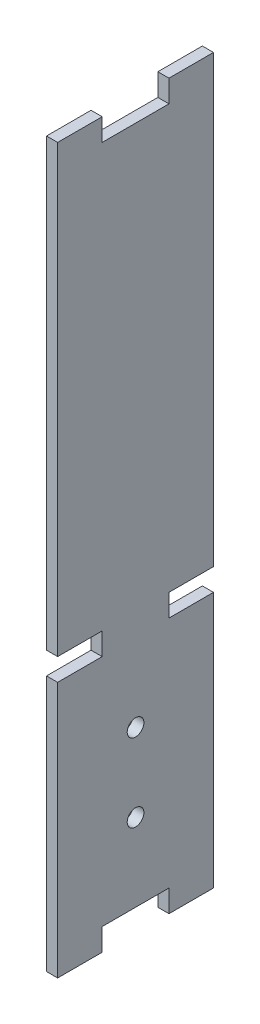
ISO-10303-21;
HEADER;
FILE_DESCRIPTION(('STEP AP214'),'2;1');
FILE_NAME('part.step','',(''),(''),'','','');
FILE_SCHEMA(('AUTOMOTIVE_DESIGN { 1 0 10303 214 1 1 1 1 }'));
ENDSEC;
DATA;
#1=APPLICATION_CONTEXT('core data for automotive mechanical design processes');
#2=APPLICATION_PROTOCOL_DEFINITION('international standard','automotive_design',2000,#1);
#3=PRODUCT_CONTEXT('',#1,'mechanical');
#4=PRODUCT('Part','Part','',(#3));
#5=PRODUCT_RELATED_PRODUCT_CATEGORY('part','',(#4));
#6=PRODUCT_DEFINITION_FORMATION('','',#4);
#7=PRODUCT_DEFINITION_CONTEXT('part definition',#1,'design');
#8=PRODUCT_DEFINITION('design','',#6,#7);
#9=PRODUCT_DEFINITION_SHAPE('','',#8);
#10=(LENGTH_UNIT() NAMED_UNIT(*) SI_UNIT(.MILLI.,.METRE.));
#11=(NAMED_UNIT(*) PLANE_ANGLE_UNIT() SI_UNIT($,.RADIAN.));
#12=(NAMED_UNIT(*) SI_UNIT($,.STERADIAN.) SOLID_ANGLE_UNIT());
#13=UNCERTAINTY_MEASURE_WITH_UNIT(LENGTH_MEASURE(1.E-05),#10,'distance_accuracy_value','');
#14=(GEOMETRIC_REPRESENTATION_CONTEXT(3) GLOBAL_UNCERTAINTY_ASSIGNED_CONTEXT((#13)) GLOBAL_UNIT_ASSIGNED_CONTEXT((#10,
#11,#12)) REPRESENTATION_CONTEXT('',''));
#15=CARTESIAN_POINT('',(0.,0.,0.));
#16=DIRECTION('',(0.,0.,1.));
#17=DIRECTION('',(1.,0.,0.));
#18=AXIS2_PLACEMENT_3D('',#15,#16,#17);
#19=CARTESIAN_POINT('',(3.175,-6.35,9.525));
#20=DIRECTION('',(-1.,0.,0.));
#21=DIRECTION('',(0.,0.,1.));
#22=AXIS2_PLACEMENT_3D('',#19,#20,#21);
#23=PLANE('',#22);
#24=CARTESIAN_POINT('',(3.175,22.225,0.));
#25=DIRECTION('',(1.,0.,0.));
#26=DIRECTION('',(0.,0.,-1.));
#27=AXIS2_PLACEMENT_3D('',#24,#25,#26);
#28=CIRCLE('',#27,2.38125);
#29=CARTESIAN_POINT('',(3.175,22.225,-2.38125));
#30=VERTEX_POINT('',#29);
#31=EDGE_CURVE('E204',#30,#30,#28,.T.);
#32=ORIENTED_EDGE('',*,*,#31,.F.);
#33=EDGE_LOOP('',(#32));
#34=FACE_BOUND('',#33,.T.);
#35=DIRECTION('',(0.,1.,0.));
#36=VECTOR('',#35,1.);
#37=CARTESIAN_POINT('',(3.175,0.,9.525));
#38=LINE('',#37,#36);
#39=CARTESIAN_POINT('',(3.175,-6.35,9.525));
#40=VERTEX_POINT('',#39);
#41=CARTESIAN_POINT('',(3.175,0.,9.525));
#42=VERTEX_POINT('',#41);
#43=EDGE_CURVE('E239',#40,#42,#38,.T.);
#44=ORIENTED_EDGE('',*,*,#43,.T.);
#45=DIRECTION('',(0.,0.,-1.));
#46=VECTOR('',#45,1.);
#47=CARTESIAN_POINT('',(3.175,0.,9.525));
#48=LINE('',#47,#46);
#49=CARTESIAN_POINT('',(3.175,0.,-9.525));
#50=VERTEX_POINT('',#49);
#51=EDGE_CURVE('E127',#42,#50,#48,.T.);
#52=ORIENTED_EDGE('',*,*,#51,.T.);
#53=DIRECTION('',(0.,-1.,0.));
#54=VECTOR('',#53,1.);
#55=CARTESIAN_POINT('',(3.175,0.,-9.525));
#56=LINE('',#55,#54);
#57=CARTESIAN_POINT('',(3.175,-6.35,-9.525));
#58=VERTEX_POINT('',#57);
#59=EDGE_CURVE('E290',#50,#58,#56,.T.);
#60=ORIENTED_EDGE('',*,*,#59,.T.);
#61=DIRECTION('',(0.,0.,-1.));
#62=VECTOR('',#61,1.);
#63=CARTESIAN_POINT('',(3.175,-6.35,-9.525));
#64=LINE('',#63,#62);
#65=CARTESIAN_POINT('',(3.175,-6.35,-22.225));
#66=VERTEX_POINT('',#65);
#67=EDGE_CURVE('E309',#58,#66,#64,.T.);
#68=ORIENTED_EDGE('',*,*,#67,.T.);
#69=DIRECTION('',(0.,1.,0.));
#70=VECTOR('',#69,1.);
#71=CARTESIAN_POINT('',(3.175,-6.35,-22.225));
#72=LINE('',#71,#70);
#73=CARTESIAN_POINT('',(3.175,66.675,-22.225));
#74=VERTEX_POINT('',#73);
#75=EDGE_CURVE('E306',#66,#74,#72,.T.);
#76=ORIENTED_EDGE('',*,*,#75,.T.);
#77=DIRECTION('',(0.,0.,1.));
#78=VECTOR('',#77,1.);
#79=CARTESIAN_POINT('',(3.175,66.675,-22.225));
#80=LINE('',#79,#78);
#81=CARTESIAN_POINT('',(3.175,66.675,-9.52500000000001));
#82=VERTEX_POINT('',#81);
#83=EDGE_CURVE('E308',#74,#82,#80,.T.);
#84=ORIENTED_EDGE('',*,*,#83,.T.);
#85=DIRECTION('',(0.,1.,0.));
#86=VECTOR('',#85,1.);
#87=CARTESIAN_POINT('',(3.175,66.675,-9.52500000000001));
#88=LINE('',#87,#86);
#89=CARTESIAN_POINT('',(3.175,73.025,-9.52500000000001));
#90=VERTEX_POINT('',#89);
#91=EDGE_CURVE('E311',#82,#90,#88,.T.);
#92=ORIENTED_EDGE('',*,*,#91,.T.);
#93=DIRECTION('',(0.,0.,-1.));
#94=VECTOR('',#93,1.);
#95=CARTESIAN_POINT('',(3.175,73.025,-9.52500000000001));
#96=LINE('',#95,#94);
#97=CARTESIAN_POINT('',(3.175,73.025,-22.225));
#98=VERTEX_POINT('',#97);
#99=EDGE_CURVE('E317',#90,#98,#96,.T.);
#100=ORIENTED_EDGE('',*,*,#99,.T.);
#101=DIRECTION('',(0.,1.,0.));
#102=VECTOR('',#101,1.);
#103=CARTESIAN_POINT('',(3.175,73.025,-22.225));
#104=LINE('',#103,#102);
#105=CARTESIAN_POINT('',(3.175,200.025,-22.225));
#106=VERTEX_POINT('',#105);
#107=EDGE_CURVE('E319',#98,#106,#104,.T.);
#108=ORIENTED_EDGE('',*,*,#107,.T.);
#109=DIRECTION('',(0.,0.,1.));
#110=VECTOR('',#109,1.);
#111=CARTESIAN_POINT('',(3.175,200.025,-22.225));
#112=LINE('',#111,#110);
#113=CARTESIAN_POINT('',(3.175,200.025,-9.52500000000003));
#114=VERTEX_POINT('',#113);
#115=EDGE_CURVE('E321',#106,#114,#112,.T.);
#116=ORIENTED_EDGE('',*,*,#115,.T.);
#117=DIRECTION('',(0.,-1.,0.));
#118=VECTOR('',#117,1.);
#119=CARTESIAN_POINT('',(3.175,200.025,-9.52500000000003));
#120=LINE('',#119,#118);
#121=CARTESIAN_POINT('',(3.175,193.675,-9.52500000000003));
#122=VERTEX_POINT('',#121);
#123=EDGE_CURVE('E323',#114,#122,#120,.T.);
#124=ORIENTED_EDGE('',*,*,#123,.T.);
#125=DIRECTION('',(0.,0.,1.));
#126=VECTOR('',#125,1.);
#127=CARTESIAN_POINT('',(3.175,193.675,9.52500000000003));
#128=LINE('',#127,#126);
#129=CARTESIAN_POINT('',(3.175,193.675,9.52500000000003));
#130=VERTEX_POINT('',#129);
#131=EDGE_CURVE('E325',#122,#130,#128,.T.);
#132=ORIENTED_EDGE('',*,*,#131,.T.);
#133=DIRECTION('',(0.,1.,0.));
#134=VECTOR('',#133,1.);
#135=CARTESIAN_POINT('',(3.175,200.025,9.52500000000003));
#136=LINE('',#135,#134);
#137=CARTESIAN_POINT('',(3.175,200.025,9.52500000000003));
#138=VERTEX_POINT('',#137);
#139=EDGE_CURVE('E327',#130,#138,#136,.T.);
#140=ORIENTED_EDGE('',*,*,#139,.T.);
#141=DIRECTION('',(0.,0.,1.));
#142=VECTOR('',#141,1.);
#143=CARTESIAN_POINT('',(3.175,200.025,22.225));
#144=LINE('',#143,#142);
#145=CARTESIAN_POINT('',(3.175,200.025,22.225));
#146=VERTEX_POINT('',#145);
#147=EDGE_CURVE('E329',#138,#146,#144,.T.);
#148=ORIENTED_EDGE('',*,*,#147,.T.);
#149=DIRECTION('',(0.,-1.,0.));
#150=VECTOR('',#149,1.);
#151=CARTESIAN_POINT('',(3.175,73.025,22.225));
#152=LINE('',#151,#150);
#153=CARTESIAN_POINT('',(3.175,73.025,22.225));
#154=VERTEX_POINT('',#153);
#155=EDGE_CURVE('E331',#146,#154,#152,.T.);
#156=ORIENTED_EDGE('',*,*,#155,.T.);
#157=DIRECTION('',(0.,0.,-1.));
#158=VECTOR('',#157,1.);
#159=CARTESIAN_POINT('',(3.175,73.025,9.52500000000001));
#160=LINE('',#159,#158);
#161=CARTESIAN_POINT('',(3.175,73.025,9.52500000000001));
#162=VERTEX_POINT('',#161);
#163=EDGE_CURVE('E333',#154,#162,#160,.T.);
#164=ORIENTED_EDGE('',*,*,#163,.T.);
#165=DIRECTION('',(0.,-1.,0.));
#166=VECTOR('',#165,1.);
#167=CARTESIAN_POINT('',(3.175,66.675,9.52500000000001));
#168=LINE('',#167,#166);
#169=CARTESIAN_POINT('',(3.175,66.675,9.52500000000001));
#170=VERTEX_POINT('',#169);
#171=EDGE_CURVE('E182',#162,#170,#168,.T.);
#172=ORIENTED_EDGE('',*,*,#171,.T.);
#173=DIRECTION('',(0.,0.,1.));
#174=VECTOR('',#173,1.);
#175=CARTESIAN_POINT('',(3.175,66.675,22.225));
#176=LINE('',#175,#174);
#177=CARTESIAN_POINT('',(3.175,66.675,22.225));
#178=VERTEX_POINT('',#177);
#179=EDGE_CURVE('E176',#170,#178,#176,.T.);
#180=ORIENTED_EDGE('',*,*,#179,.T.);
#181=DIRECTION('',(0.,-1.,0.));
#182=VECTOR('',#181,1.);
#183=CARTESIAN_POINT('',(3.175,-6.35,22.225));
#184=LINE('',#183,#182);
#185=CARTESIAN_POINT('',(3.175,-6.35,22.225));
#186=VERTEX_POINT('',#185);
#187=EDGE_CURVE('E180',#178,#186,#184,.T.);
#188=ORIENTED_EDGE('',*,*,#187,.T.);
#189=DIRECTION('',(0.,0.,-1.));
#190=VECTOR('',#189,1.);
#191=CARTESIAN_POINT('',(3.175,-6.35,9.525));
#192=LINE('',#191,#190);
#193=EDGE_CURVE('E48',#186,#40,#192,.T.);
#194=ORIENTED_EDGE('',*,*,#193,.T.);
#195=EDGE_LOOP('',(#44,#52,#60,#68,#76,#84,#92,#100,#108,#116,#124,#132,#140,#148,#156,#164,
#172,#180,#188,#194));
#196=FACE_BOUND('',#195,.T.);
#197=CARTESIAN_POINT('',(3.175,44.4500000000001,0.));
#198=DIRECTION('',(1.,0.,0.));
#199=DIRECTION('',(0.,0.,-1.));
#200=AXIS2_PLACEMENT_3D('',#197,#198,#199);
#201=CIRCLE('',#200,2.38125);
#202=CARTESIAN_POINT('',(3.175,44.4500000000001,-2.38125));
#203=VERTEX_POINT('',#202);
#204=EDGE_CURVE('E376',#203,#203,#201,.T.);
#205=ORIENTED_EDGE('',*,*,#204,.F.);
#206=EDGE_LOOP('',(#205));
#207=FACE_BOUND('',#206,.T.);
#208=ADVANCED_FACE('F31',(#34,#196,#207),#23,.F.);
#209=CARTESIAN_POINT('',(0.,-6.35,9.525));
#210=DIRECTION('',(-1.,0.,0.));
#211=DIRECTION('',(0.,0.,1.));
#212=AXIS2_PLACEMENT_3D('',#209,#210,#211);
#213=PLANE('',#212);
#214=CARTESIAN_POINT('',(0.,22.225,0.));
#215=DIRECTION('',(1.,0.,0.));
#216=DIRECTION('',(0.,0.,-1.));
#217=AXIS2_PLACEMENT_3D('',#214,#215,#216);
#218=CIRCLE('',#217,2.38125);
#219=CARTESIAN_POINT('',(0.,22.225,-2.38125));
#220=VERTEX_POINT('',#219);
#221=EDGE_CURVE('E381',#220,#220,#218,.T.);
#222=ORIENTED_EDGE('',*,*,#221,.T.);
#223=EDGE_LOOP('',(#222));
#224=FACE_BOUND('',#223,.T.);
#225=DIRECTION('',(0.,1.,0.));
#226=VECTOR('',#225,1.);
#227=CARTESIAN_POINT('',(0.,0.,9.525));
#228=LINE('',#227,#226);
#229=CARTESIAN_POINT('',(0.,-6.35,9.525));
#230=VERTEX_POINT('',#229);
#231=CARTESIAN_POINT('',(0.,0.,9.525));
#232=VERTEX_POINT('',#231);
#233=EDGE_CURVE('E200',#230,#232,#228,.T.);
#234=ORIENTED_EDGE('',*,*,#233,.F.);
#235=DIRECTION('',(0.,0.,-1.));
#236=VECTOR('',#235,1.);
#237=CARTESIAN_POINT('',(0.,-6.35,9.525));
#238=LINE('',#237,#236);
#239=CARTESIAN_POINT('',(0.,-6.35,22.225));
#240=VERTEX_POINT('',#239);
#241=EDGE_CURVE('E119',#240,#230,#238,.T.);
#242=ORIENTED_EDGE('',*,*,#241,.F.);
#243=DIRECTION('',(0.,-1.,0.));
#244=VECTOR('',#243,1.);
#245=CARTESIAN_POINT('',(0.,-6.35,22.225));
#246=LINE('',#245,#244);
#247=CARTESIAN_POINT('',(0.,66.675,22.225));
#248=VERTEX_POINT('',#247);
#249=EDGE_CURVE('E113',#248,#240,#246,.T.);
#250=ORIENTED_EDGE('',*,*,#249,.F.);
#251=DIRECTION('',(0.,0.,1.));
#252=VECTOR('',#251,1.);
#253=CARTESIAN_POINT('',(0.,66.675,22.225));
#254=LINE('',#253,#252);
#255=CARTESIAN_POINT('',(0.,66.675,9.52500000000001));
#256=VERTEX_POINT('',#255);
#257=EDGE_CURVE('E190',#256,#248,#254,.T.);
#258=ORIENTED_EDGE('',*,*,#257,.F.);
#259=DIRECTION('',(0.,-1.,0.));
#260=VECTOR('',#259,1.);
#261=CARTESIAN_POINT('',(0.,66.675,9.52500000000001));
#262=LINE('',#261,#260);
#263=CARTESIAN_POINT('',(0.,73.025,9.52500000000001));
#264=VERTEX_POINT('',#263);
#265=EDGE_CURVE('E234',#264,#256,#262,.T.);
#266=ORIENTED_EDGE('',*,*,#265,.F.);
#267=DIRECTION('',(0.,0.,-1.));
#268=VECTOR('',#267,1.);
#269=CARTESIAN_POINT('',(0.,73.025,9.52500000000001));
#270=LINE('',#269,#268);
#271=CARTESIAN_POINT('',(0.,73.025,22.225));
#272=VERTEX_POINT('',#271);
#273=EDGE_CURVE('E232',#272,#264,#270,.T.);
#274=ORIENTED_EDGE('',*,*,#273,.F.);
#275=DIRECTION('',(0.,-1.,0.));
#276=VECTOR('',#275,1.);
#277=CARTESIAN_POINT('',(0.,73.025,22.225));
#278=LINE('',#277,#276);
#279=CARTESIAN_POINT('',(0.,200.025,22.225));
#280=VERTEX_POINT('',#279);
#281=EDGE_CURVE('E230',#280,#272,#278,.T.);
#282=ORIENTED_EDGE('',*,*,#281,.F.);
#283=DIRECTION('',(0.,0.,1.));
#284=VECTOR('',#283,1.);
#285=CARTESIAN_POINT('',(0.,200.025,22.225));
#286=LINE('',#285,#284);
#287=CARTESIAN_POINT('',(0.,200.025,9.52500000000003));
#288=VERTEX_POINT('',#287);
#289=EDGE_CURVE('E228',#288,#280,#286,.T.);
#290=ORIENTED_EDGE('',*,*,#289,.F.);
#291=DIRECTION('',(0.,1.,0.));
#292=VECTOR('',#291,1.);
#293=CARTESIAN_POINT('',(0.,200.025,9.52500000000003));
#294=LINE('',#293,#292);
#295=CARTESIAN_POINT('',(0.,193.675,9.52500000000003));
#296=VERTEX_POINT('',#295);
#297=EDGE_CURVE('E226',#296,#288,#294,.T.);
#298=ORIENTED_EDGE('',*,*,#297,.F.);
#299=DIRECTION('',(0.,0.,1.));
#300=VECTOR('',#299,1.);
#301=CARTESIAN_POINT('',(0.,193.675,9.52500000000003));
#302=LINE('',#301,#300);
#303=CARTESIAN_POINT('',(0.,193.675,-9.52500000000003));
#304=VERTEX_POINT('',#303);
#305=EDGE_CURVE('E224',#304,#296,#302,.T.);
#306=ORIENTED_EDGE('',*,*,#305,.F.);
#307=DIRECTION('',(0.,-1.,0.));
#308=VECTOR('',#307,1.);
#309=CARTESIAN_POINT('',(0.,200.025,-9.52500000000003));
#310=LINE('',#309,#308);
#311=CARTESIAN_POINT('',(0.,200.025,-9.52500000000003));
#312=VERTEX_POINT('',#311);
#313=EDGE_CURVE('E222',#312,#304,#310,.T.);
#314=ORIENTED_EDGE('',*,*,#313,.F.);
#315=DIRECTION('',(0.,0.,1.));
#316=VECTOR('',#315,1.);
#317=CARTESIAN_POINT('',(0.,200.025,-22.225));
#318=LINE('',#317,#316);
#319=CARTESIAN_POINT('',(0.,200.025,-22.225));
#320=VERTEX_POINT('',#319);
#321=EDGE_CURVE('E220',#320,#312,#318,.T.);
#322=ORIENTED_EDGE('',*,*,#321,.F.);
#323=DIRECTION('',(0.,1.,0.));
#324=VECTOR('',#323,1.);
#325=CARTESIAN_POINT('',(0.,73.025,-22.225));
#326=LINE('',#325,#324);
#327=CARTESIAN_POINT('',(0.,73.025,-22.225));
#328=VERTEX_POINT('',#327);
#329=EDGE_CURVE('E218',#328,#320,#326,.T.);
#330=ORIENTED_EDGE('',*,*,#329,.F.);
#331=DIRECTION('',(0.,0.,-1.));
#332=VECTOR('',#331,1.);
#333=CARTESIAN_POINT('',(0.,73.025,-9.52500000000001));
#334=LINE('',#333,#332);
#335=CARTESIAN_POINT('',(0.,73.025,-9.52500000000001));
#336=VERTEX_POINT('',#335);
#337=EDGE_CURVE('E216',#336,#328,#334,.T.);
#338=ORIENTED_EDGE('',*,*,#337,.F.);
#339=DIRECTION('',(0.,1.,0.));
#340=VECTOR('',#339,1.);
#341=CARTESIAN_POINT('',(0.,66.675,-9.52500000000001));
#342=LINE('',#341,#340);
#343=CARTESIAN_POINT('',(0.,66.675,-9.52500000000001));
#344=VERTEX_POINT('',#343);
#345=EDGE_CURVE('E214',#344,#336,#342,.T.);
#346=ORIENTED_EDGE('',*,*,#345,.F.);
#347=DIRECTION('',(0.,0.,1.));
#348=VECTOR('',#347,1.);
#349=CARTESIAN_POINT('',(0.,66.675,-22.225));
#350=LINE('',#349,#348);
#351=CARTESIAN_POINT('',(0.,66.675,-22.225));
#352=VERTEX_POINT('',#351);
#353=EDGE_CURVE('E212',#352,#344,#350,.T.);
#354=ORIENTED_EDGE('',*,*,#353,.F.);
#355=DIRECTION('',(0.,1.,0.));
#356=VECTOR('',#355,1.);
#357=CARTESIAN_POINT('',(0.,-6.35,-22.225));
#358=LINE('',#357,#356);
#359=CARTESIAN_POINT('',(0.,-6.35,-22.225));
#360=VERTEX_POINT('',#359);
#361=EDGE_CURVE('E210',#360,#352,#358,.T.);
#362=ORIENTED_EDGE('',*,*,#361,.F.);
#363=DIRECTION('',(0.,0.,-1.));
#364=VECTOR('',#363,1.);
#365=CARTESIAN_POINT('',(0.,-6.35,-9.525));
#366=LINE('',#365,#364);
#367=CARTESIAN_POINT('',(0.,-6.35,-9.525));
#368=VERTEX_POINT('',#367);
#369=EDGE_CURVE('E208',#368,#360,#366,.T.);
#370=ORIENTED_EDGE('',*,*,#369,.F.);
#371=DIRECTION('',(0.,-1.,0.));
#372=VECTOR('',#371,1.);
#373=CARTESIAN_POINT('',(0.,0.,-9.525));
#374=LINE('',#373,#372);
#375=CARTESIAN_POINT('',(0.,0.,-9.525));
#376=VERTEX_POINT('',#375);
#377=EDGE_CURVE('E206',#376,#368,#374,.T.);
#378=ORIENTED_EDGE('',*,*,#377,.F.);
#379=DIRECTION('',(0.,0.,-1.));
#380=VECTOR('',#379,1.);
#381=CARTESIAN_POINT('',(0.,0.,9.525));
#382=LINE('',#381,#380);
#383=EDGE_CURVE('E203',#232,#376,#382,.T.);
#384=ORIENTED_EDGE('',*,*,#383,.F.);
#385=EDGE_LOOP('',(#234,#242,#250,#258,#266,#274,#282,#290,#298,#306,#314,#322,#330,#338,#346,
#354,#362,#370,#378,#384));
#386=FACE_BOUND('',#385,.T.);
#387=CARTESIAN_POINT('',(0.,44.4500000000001,0.));
#388=DIRECTION('',(1.,0.,0.));
#389=DIRECTION('',(0.,0.,-1.));
#390=AXIS2_PLACEMENT_3D('',#387,#388,#389);
#391=CIRCLE('',#390,2.38125);
#392=CARTESIAN_POINT('',(0.,44.4500000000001,-2.38125));
#393=VERTEX_POINT('',#392);
#394=EDGE_CURVE('E379',#393,#393,#391,.T.);
#395=ORIENTED_EDGE('',*,*,#394,.T.);
#396=EDGE_LOOP('',(#395));
#397=FACE_BOUND('',#396,.T.);
#398=ADVANCED_FACE('F294',(#224,#386,#397),#213,.T.);
#399=CARTESIAN_POINT('',(3.175,0.,9.525));
#400=DIRECTION('',(0.,0.,1.));
#401=DIRECTION('',(0.,-1.,0.));
#402=AXIS2_PLACEMENT_3D('',#399,#400,#401);
#403=PLANE('',#402);
#404=ORIENTED_EDGE('',*,*,#233,.T.);
#405=DIRECTION('',(-1.,0.,0.));
#406=VECTOR('',#405,1.);
#407=CARTESIAN_POINT('',(3.175,0.,9.525));
#408=LINE('',#407,#406);
#409=EDGE_CURVE('E11',#42,#232,#408,.T.);
#410=ORIENTED_EDGE('',*,*,#409,.F.);
#411=ORIENTED_EDGE('',*,*,#43,.F.);
#412=DIRECTION('',(-1.,0.,0.));
#413=VECTOR('',#412,1.);
#414=CARTESIAN_POINT('',(3.175,-6.35,9.525));
#415=LINE('',#414,#413);
#416=EDGE_CURVE('E196',#40,#230,#415,.T.);
#417=ORIENTED_EDGE('',*,*,#416,.T.);
#418=EDGE_LOOP('',(#404,#410,#411,#417));
#419=FACE_BOUND('',#418,.T.);
#420=ADVANCED_FACE('F33',(#419),#403,.F.);
#421=CARTESIAN_POINT('',(3.175,0.,9.525));
#422=DIRECTION('',(0.,1.,0.));
#423=DIRECTION('',(0.,0.,1.));
#424=AXIS2_PLACEMENT_3D('',#421,#422,#423);
#425=PLANE('',#424);
#426=ORIENTED_EDGE('',*,*,#383,.T.);
#427=DIRECTION('',(-1.,0.,0.));
#428=VECTOR('',#427,1.);
#429=CARTESIAN_POINT('',(3.175,0.,-9.525));
#430=LINE('',#429,#428);
#431=EDGE_CURVE('E40',#50,#376,#430,.T.);
#432=ORIENTED_EDGE('',*,*,#431,.F.);
#433=ORIENTED_EDGE('',*,*,#51,.F.);
#434=ORIENTED_EDGE('',*,*,#409,.T.);
#435=EDGE_LOOP('',(#426,#432,#433,#434));
#436=FACE_BOUND('',#435,.T.);
#437=ADVANCED_FACE('F554',(#436),#425,.F.);
#438=CARTESIAN_POINT('',(3.175,0.,-9.525));
#439=DIRECTION('',(0.,0.,-1.));
#440=DIRECTION('',(0.,1.,0.));
#441=AXIS2_PLACEMENT_3D('',#438,#439,#440);
#442=PLANE('',#441);
#443=ORIENTED_EDGE('',*,*,#377,.T.);
#444=DIRECTION('',(-1.,0.,0.));
#445=VECTOR('',#444,1.);
#446=CARTESIAN_POINT('',(3.175,-6.35,-9.525));
#447=LINE('',#446,#445);
#448=EDGE_CURVE('E282',#58,#368,#447,.T.);
#449=ORIENTED_EDGE('',*,*,#448,.F.);
#450=ORIENTED_EDGE('',*,*,#59,.F.);
#451=ORIENTED_EDGE('',*,*,#431,.T.);
#452=EDGE_LOOP('',(#443,#449,#450,#451));
#453=FACE_BOUND('',#452,.T.);
#454=ADVANCED_FACE('F288',(#453),#442,.F.);
#455=CARTESIAN_POINT('',(3.175,-6.35,-9.525));
#456=DIRECTION('',(0.,1.,0.));
#457=DIRECTION('',(0.,0.,1.));
#458=AXIS2_PLACEMENT_3D('',#455,#456,#457);
#459=PLANE('',#458);
#460=ORIENTED_EDGE('',*,*,#369,.T.);
#461=DIRECTION('',(-1.,0.,0.));
#462=VECTOR('',#461,1.);
#463=CARTESIAN_POINT('',(3.175,-6.35,-22.225));
#464=LINE('',#463,#462);
#465=EDGE_CURVE('E279',#66,#360,#464,.T.);
#466=ORIENTED_EDGE('',*,*,#465,.F.);
#467=ORIENTED_EDGE('',*,*,#67,.F.);
#468=ORIENTED_EDGE('',*,*,#448,.T.);
#469=EDGE_LOOP('',(#460,#466,#467,#468));
#470=FACE_BOUND('',#469,.T.);
#471=ADVANCED_FACE('F300',(#470),#459,.F.);
#472=CARTESIAN_POINT('',(3.175,-6.35,-22.225));
#473=DIRECTION('',(0.,0.,1.));
#474=DIRECTION('',(1.,0.,0.));
#475=AXIS2_PLACEMENT_3D('',#472,#473,#474);
#476=PLANE('',#475);
#477=ORIENTED_EDGE('',*,*,#361,.T.);
#478=DIRECTION('',(-1.,0.,0.));
#479=VECTOR('',#478,1.);
#480=CARTESIAN_POINT('',(3.175,66.675,-22.225));
#481=LINE('',#480,#479);
#482=EDGE_CURVE('E276',#74,#352,#481,.T.);
#483=ORIENTED_EDGE('',*,*,#482,.F.);
#484=ORIENTED_EDGE('',*,*,#75,.F.);
#485=ORIENTED_EDGE('',*,*,#465,.T.);
#486=EDGE_LOOP('',(#477,#483,#484,#485));
#487=FACE_BOUND('',#486,.T.);
#488=ADVANCED_FACE('F304',(#487),#476,.F.);
#489=CARTESIAN_POINT('',(3.175,66.675,-22.225));
#490=DIRECTION('',(0.,-1.,0.));
#491=DIRECTION('',(0.,0.,-1.));
#492=AXIS2_PLACEMENT_3D('',#489,#490,#491);
#493=PLANE('',#492);
#494=ORIENTED_EDGE('',*,*,#353,.T.);
#495=DIRECTION('',(-1.,0.,0.));
#496=VECTOR('',#495,1.);
#497=CARTESIAN_POINT('',(3.175,66.675,-9.52500000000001));
#498=LINE('',#497,#496);
#499=EDGE_CURVE('E273',#82,#344,#498,.T.);
#500=ORIENTED_EDGE('',*,*,#499,.F.);
#501=ORIENTED_EDGE('',*,*,#83,.F.);
#502=ORIENTED_EDGE('',*,*,#482,.T.);
#503=EDGE_LOOP('',(#494,#500,#501,#502));
#504=FACE_BOUND('',#503,.T.);
#505=ADVANCED_FACE('F519',(#504),#493,.F.);
#506=CARTESIAN_POINT('',(3.175,66.675,-9.52500000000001));
#507=DIRECTION('',(0.,0.,1.));
#508=DIRECTION('',(0.,-1.,0.));
#509=AXIS2_PLACEMENT_3D('',#506,#507,#508);
#510=PLANE('',#509);
#511=ORIENTED_EDGE('',*,*,#345,.T.);
#512=DIRECTION('',(-1.,0.,0.));
#513=VECTOR('',#512,1.);
#514=CARTESIAN_POINT('',(3.175,73.025,-9.52500000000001));
#515=LINE('',#514,#513);
#516=EDGE_CURVE('E270',#90,#336,#515,.T.);
#517=ORIENTED_EDGE('',*,*,#516,.F.);
#518=ORIENTED_EDGE('',*,*,#91,.F.);
#519=ORIENTED_EDGE('',*,*,#499,.T.);
#520=EDGE_LOOP('',(#511,#517,#518,#519));
#521=FACE_BOUND('',#520,.T.);
#522=ADVANCED_FACE('F509',(#521),#510,.F.);
#523=CARTESIAN_POINT('',(3.175,73.025,-9.52500000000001));
#524=DIRECTION('',(0.,1.,0.));
#525=DIRECTION('',(0.,0.,1.));
#526=AXIS2_PLACEMENT_3D('',#523,#524,#525);
#527=PLANE('',#526);
#528=ORIENTED_EDGE('',*,*,#337,.T.);
#529=DIRECTION('',(-1.,0.,0.));
#530=VECTOR('',#529,1.);
#531=CARTESIAN_POINT('',(3.175,73.025,-22.225));
#532=LINE('',#531,#530);
#533=EDGE_CURVE('E267',#98,#328,#532,.T.);
#534=ORIENTED_EDGE('',*,*,#533,.F.);
#535=ORIENTED_EDGE('',*,*,#99,.F.);
#536=ORIENTED_EDGE('',*,*,#516,.T.);
#537=EDGE_LOOP('',(#528,#534,#535,#536));
#538=FACE_BOUND('',#537,.T.);
#539=ADVANCED_FACE('F499',(#538),#527,.F.);
#540=CARTESIAN_POINT('',(3.175,73.025,-22.225));
#541=DIRECTION('',(0.,0.,1.));
#542=DIRECTION('',(1.,0.,0.));
#543=AXIS2_PLACEMENT_3D('',#540,#541,#542);
#544=PLANE('',#543);
#545=ORIENTED_EDGE('',*,*,#329,.T.);
#546=DIRECTION('',(-1.,0.,0.));
#547=VECTOR('',#546,1.);
#548=CARTESIAN_POINT('',(3.175,200.025,-22.225));
#549=LINE('',#548,#547);
#550=EDGE_CURVE('E264',#106,#320,#549,.T.);
#551=ORIENTED_EDGE('',*,*,#550,.F.);
#552=ORIENTED_EDGE('',*,*,#107,.F.);
#553=ORIENTED_EDGE('',*,*,#533,.T.);
#554=EDGE_LOOP('',(#545,#551,#552,#553));
#555=FACE_BOUND('',#554,.T.);
#556=ADVANCED_FACE('F489',(#555),#544,.F.);
#557=CARTESIAN_POINT('',(3.175,200.025,-22.225));
#558=DIRECTION('',(0.,-1.,0.));
#559=DIRECTION('',(0.,0.,-1.));
#560=AXIS2_PLACEMENT_3D('',#557,#558,#559);
#561=PLANE('',#560);
#562=ORIENTED_EDGE('',*,*,#321,.T.);
#563=DIRECTION('',(-1.,0.,0.));
#564=VECTOR('',#563,1.);
#565=CARTESIAN_POINT('',(3.175,200.025,-9.52500000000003));
#566=LINE('',#565,#564);
#567=EDGE_CURVE('E261',#114,#312,#566,.T.);
#568=ORIENTED_EDGE('',*,*,#567,.F.);
#569=ORIENTED_EDGE('',*,*,#115,.F.);
#570=ORIENTED_EDGE('',*,*,#550,.T.);
#571=EDGE_LOOP('',(#562,#568,#569,#570));
#572=FACE_BOUND('',#571,.T.);
#573=ADVANCED_FACE('F479',(#572),#561,.F.);
#574=CARTESIAN_POINT('',(3.175,200.025,-9.52500000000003));
#575=DIRECTION('',(0.,0.,-1.));
#576=DIRECTION('',(-1.,0.,0.));
#577=AXIS2_PLACEMENT_3D('',#574,#575,#576);
#578=PLANE('',#577);
#579=ORIENTED_EDGE('',*,*,#313,.T.);
#580=DIRECTION('',(-1.,0.,0.));
#581=VECTOR('',#580,1.);
#582=CARTESIAN_POINT('',(3.175,193.675,-9.52500000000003));
#583=LINE('',#582,#581);
#584=EDGE_CURVE('E258',#122,#304,#583,.T.);
#585=ORIENTED_EDGE('',*,*,#584,.F.);
#586=ORIENTED_EDGE('',*,*,#123,.F.);
#587=ORIENTED_EDGE('',*,*,#567,.T.);
#588=EDGE_LOOP('',(#579,#585,#586,#587));
#589=FACE_BOUND('',#588,.T.);
#590=ADVANCED_FACE('F469',(#589),#578,.F.);
#591=CARTESIAN_POINT('',(3.175,193.675,9.52500000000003));
#592=DIRECTION('',(0.,-1.,0.));
#593=DIRECTION('',(0.,0.,-1.));
#594=AXIS2_PLACEMENT_3D('',#591,#592,#593);
#595=PLANE('',#594);
#596=ORIENTED_EDGE('',*,*,#305,.T.);
#597=DIRECTION('',(-1.,0.,0.));
#598=VECTOR('',#597,1.);
#599=CARTESIAN_POINT('',(3.175,193.675,9.52500000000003));
#600=LINE('',#599,#598);
#601=EDGE_CURVE('E255',#130,#296,#600,.T.);
#602=ORIENTED_EDGE('',*,*,#601,.F.);
#603=ORIENTED_EDGE('',*,*,#131,.F.);
#604=ORIENTED_EDGE('',*,*,#584,.T.);
#605=EDGE_LOOP('',(#596,#602,#603,#604));
#606=FACE_BOUND('',#605,.T.);
#607=ADVANCED_FACE('F459',(#606),#595,.F.);
#608=CARTESIAN_POINT('',(3.175,200.025,9.52500000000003));
#609=DIRECTION('',(0.,0.,1.));
#610=DIRECTION('',(1.,0.,0.));
#611=AXIS2_PLACEMENT_3D('',#608,#609,#610);
#612=PLANE('',#611);
#613=ORIENTED_EDGE('',*,*,#297,.T.);
#614=DIRECTION('',(-1.,0.,0.));
#615=VECTOR('',#614,1.);
#616=CARTESIAN_POINT('',(3.175,200.025,9.52500000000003));
#617=LINE('',#616,#615);
#618=EDGE_CURVE('E252',#138,#288,#617,.T.);
#619=ORIENTED_EDGE('',*,*,#618,.F.);
#620=ORIENTED_EDGE('',*,*,#139,.F.);
#621=ORIENTED_EDGE('',*,*,#601,.T.);
#622=EDGE_LOOP('',(#613,#619,#620,#621));
#623=FACE_BOUND('',#622,.T.);
#624=ADVANCED_FACE('F449',(#623),#612,.F.);
#625=CARTESIAN_POINT('',(3.175,200.025,22.225));
#626=DIRECTION('',(0.,-1.,0.));
#627=DIRECTION('',(0.,0.,-1.));
#628=AXIS2_PLACEMENT_3D('',#625,#626,#627);
#629=PLANE('',#628);
#630=ORIENTED_EDGE('',*,*,#289,.T.);
#631=DIRECTION('',(-1.,0.,0.));
#632=VECTOR('',#631,1.);
#633=CARTESIAN_POINT('',(3.175,200.025,22.225));
#634=LINE('',#633,#632);
#635=EDGE_CURVE('E249',#146,#280,#634,.T.);
#636=ORIENTED_EDGE('',*,*,#635,.F.);
#637=ORIENTED_EDGE('',*,*,#147,.F.);
#638=ORIENTED_EDGE('',*,*,#618,.T.);
#639=EDGE_LOOP('',(#630,#636,#637,#638));
#640=FACE_BOUND('',#639,.T.);
#641=ADVANCED_FACE('F439',(#640),#629,.F.);
#642=CARTESIAN_POINT('',(3.175,73.025,22.225));
#643=DIRECTION('',(0.,0.,-1.));
#644=DIRECTION('',(-1.,0.,0.));
#645=AXIS2_PLACEMENT_3D('',#642,#643,#644);
#646=PLANE('',#645);
#647=ORIENTED_EDGE('',*,*,#281,.T.);
#648=DIRECTION('',(-1.,0.,0.));
#649=VECTOR('',#648,1.);
#650=CARTESIAN_POINT('',(3.175,73.025,22.225));
#651=LINE('',#650,#649);
#652=EDGE_CURVE('E246',#154,#272,#651,.T.);
#653=ORIENTED_EDGE('',*,*,#652,.F.);
#654=ORIENTED_EDGE('',*,*,#155,.F.);
#655=ORIENTED_EDGE('',*,*,#635,.T.);
#656=EDGE_LOOP('',(#647,#653,#654,#655));
#657=FACE_BOUND('',#656,.T.);
#658=ADVANCED_FACE('F430',(#657),#646,.F.);
#659=CARTESIAN_POINT('',(3.175,73.025,9.52500000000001));
#660=DIRECTION('',(0.,1.,0.));
#661=DIRECTION('',(0.,0.,1.));
#662=AXIS2_PLACEMENT_3D('',#659,#660,#661);
#663=PLANE('',#662);
#664=ORIENTED_EDGE('',*,*,#273,.T.);
#665=DIRECTION('',(-1.,0.,0.));
#666=VECTOR('',#665,1.);
#667=CARTESIAN_POINT('',(3.175,73.025,9.52500000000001));
#668=LINE('',#667,#666);
#669=EDGE_CURVE('E243',#162,#264,#668,.T.);
#670=ORIENTED_EDGE('',*,*,#669,.F.);
#671=ORIENTED_EDGE('',*,*,#163,.F.);
#672=ORIENTED_EDGE('',*,*,#652,.T.);
#673=EDGE_LOOP('',(#664,#670,#671,#672));
#674=FACE_BOUND('',#673,.T.);
#675=ADVANCED_FACE('F339',(#674),#663,.F.);
#676=CARTESIAN_POINT('',(3.175,66.675,9.52500000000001));
#677=DIRECTION('',(0.,0.,-1.));
#678=DIRECTION('',(0.,1.,0.));
#679=AXIS2_PLACEMENT_3D('',#676,#677,#678);
#680=PLANE('',#679);
#681=ORIENTED_EDGE('',*,*,#265,.T.);
#682=DIRECTION('',(-1.,0.,0.));
#683=VECTOR('',#682,1.);
#684=CARTESIAN_POINT('',(3.175,66.675,9.52500000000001));
#685=LINE('',#684,#683);
#686=EDGE_CURVE('E191',#170,#256,#685,.T.);
#687=ORIENTED_EDGE('',*,*,#686,.F.);
#688=ORIENTED_EDGE('',*,*,#171,.F.);
#689=ORIENTED_EDGE('',*,*,#669,.T.);
#690=EDGE_LOOP('',(#681,#687,#688,#689));
#691=FACE_BOUND('',#690,.T.);
#692=ADVANCED_FACE('F343',(#691),#680,.F.);
#693=CARTESIAN_POINT('',(3.175,66.675,22.225));
#694=DIRECTION('',(0.,-1.,0.));
#695=DIRECTION('',(0.,0.,-1.));
#696=AXIS2_PLACEMENT_3D('',#693,#694,#695);
#697=PLANE('',#696);
#698=ORIENTED_EDGE('',*,*,#257,.T.);
#699=DIRECTION('',(-1.,0.,0.));
#700=VECTOR('',#699,1.);
#701=CARTESIAN_POINT('',(3.175,66.675,22.225));
#702=LINE('',#701,#700);
#703=EDGE_CURVE('E187',#178,#248,#702,.T.);
#704=ORIENTED_EDGE('',*,*,#703,.F.);
#705=ORIENTED_EDGE('',*,*,#179,.F.);
#706=ORIENTED_EDGE('',*,*,#686,.T.);
#707=EDGE_LOOP('',(#698,#704,#705,#706));
#708=FACE_BOUND('',#707,.T.);
#709=ADVANCED_FACE('F188',(#708),#697,.F.);
#710=CARTESIAN_POINT('',(3.175,-6.35,22.225));
#711=DIRECTION('',(0.,0.,-1.));
#712=DIRECTION('',(-1.,0.,0.));
#713=AXIS2_PLACEMENT_3D('',#710,#711,#712);
#714=PLANE('',#713);
#715=ORIENTED_EDGE('',*,*,#249,.T.);
#716=DIRECTION('',(-1.,0.,0.));
#717=VECTOR('',#716,1.);
#718=CARTESIAN_POINT('',(3.175,-6.35,22.225));
#719=LINE('',#718,#717);
#720=EDGE_CURVE('E192',#186,#240,#719,.T.);
#721=ORIENTED_EDGE('',*,*,#720,.F.);
#722=ORIENTED_EDGE('',*,*,#187,.F.);
#723=ORIENTED_EDGE('',*,*,#703,.T.);
#724=EDGE_LOOP('',(#715,#721,#722,#723));
#725=FACE_BOUND('',#724,.T.);
#726=ADVANCED_FACE('F194',(#725),#714,.F.);
#727=CARTESIAN_POINT('',(3.175,-6.35,9.525));
#728=DIRECTION('',(0.,1.,0.));
#729=DIRECTION('',(0.,0.,1.));
#730=AXIS2_PLACEMENT_3D('',#727,#728,#729);
#731=PLANE('',#730);
#732=ORIENTED_EDGE('',*,*,#241,.T.);
#733=ORIENTED_EDGE('',*,*,#416,.F.);
#734=ORIENTED_EDGE('',*,*,#193,.F.);
#735=ORIENTED_EDGE('',*,*,#720,.T.);
#736=EDGE_LOOP('',(#732,#733,#734,#735));
#737=FACE_BOUND('',#736,.T.);
#738=ADVANCED_FACE('F347',(#737),#731,.F.);
#739=CARTESIAN_POINT('',(3.175,22.225,0.));
#740=DIRECTION('',(-1.,0.,0.));
#741=DIRECTION('',(0.,0.,1.));
#742=AXIS2_PLACEMENT_3D('',#739,#740,#741);
#743=CYLINDRICAL_SURFACE('',#742,2.38125);
#744=ORIENTED_EDGE('',*,*,#31,.T.);
#745=EDGE_LOOP('',(#744));
#746=FACE_BOUND('',#745,.T.);
#747=ORIENTED_EDGE('',*,*,#221,.F.);
#748=EDGE_LOOP('',(#747));
#749=FACE_BOUND('',#748,.T.);
#750=ADVANCED_FACE('F349',(#746,#749),#743,.F.);
#751=CARTESIAN_POINT('',(3.175,44.4500000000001,0.));
#752=DIRECTION('',(-1.,0.,0.));
#753=DIRECTION('',(0.,0.,1.));
#754=AXIS2_PLACEMENT_3D('',#751,#752,#753);
#755=CYLINDRICAL_SURFACE('',#754,2.38125);
#756=ORIENTED_EDGE('',*,*,#204,.T.);
#757=EDGE_LOOP('',(#756));
#758=FACE_BOUND('',#757,.T.);
#759=ORIENTED_EDGE('',*,*,#394,.F.);
#760=EDGE_LOOP('',(#759));
#761=FACE_BOUND('',#760,.T.);
#762=ADVANCED_FACE('F355',(#758,#761),#755,.F.);
#763=CLOSED_SHELL('',(#208,#398,#420,#437,#454,#471,#488,#505,#522,#539,#556,#573,#590,#607,
#624,#641,#658,#675,#692,#709,#726,#738,#750,#762));
#764=MANIFOLD_SOLID_BREP('B2',#763);
#765=ADVANCED_BREP_SHAPE_REPRESENTATION('',(#18,#764),#14);
#766=SHAPE_DEFINITION_REPRESENTATION(#9,#765);
ENDSEC;
END-ISO-10303-21;
